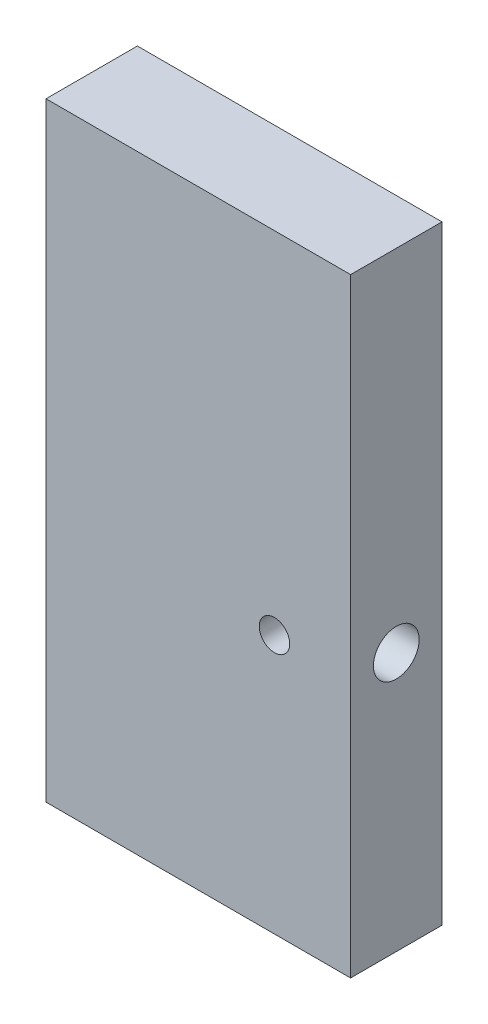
ISO-10303-21;
HEADER;
FILE_DESCRIPTION(('STEP AP214'),'2;1');
FILE_NAME('part.step','',(''),(''),'','','');
FILE_SCHEMA(('AUTOMOTIVE_DESIGN { 1 0 10303 214 1 1 1 1 }'));
ENDSEC;
DATA;
#1=APPLICATION_CONTEXT('core data for automotive mechanical design processes');
#2=APPLICATION_PROTOCOL_DEFINITION('international standard','automotive_design',2000,#1);
#3=PRODUCT_CONTEXT('',#1,'mechanical');
#4=PRODUCT('Part','Part','',(#3));
#5=PRODUCT_RELATED_PRODUCT_CATEGORY('part','',(#4));
#6=PRODUCT_DEFINITION_FORMATION('','',#4);
#7=PRODUCT_DEFINITION_CONTEXT('part definition',#1,'design');
#8=PRODUCT_DEFINITION('design','',#6,#7);
#9=PRODUCT_DEFINITION_SHAPE('','',#8);
#10=(LENGTH_UNIT() NAMED_UNIT(*) SI_UNIT(.MILLI.,.METRE.));
#11=(NAMED_UNIT(*) PLANE_ANGLE_UNIT() SI_UNIT($,.RADIAN.));
#12=(NAMED_UNIT(*) SI_UNIT($,.STERADIAN.) SOLID_ANGLE_UNIT());
#13=UNCERTAINTY_MEASURE_WITH_UNIT(LENGTH_MEASURE(1.E-05),#10,'distance_accuracy_value','');
#14=(GEOMETRIC_REPRESENTATION_CONTEXT(3) GLOBAL_UNCERTAINTY_ASSIGNED_CONTEXT((#13)) GLOBAL_UNIT_ASSIGNED_CONTEXT((#10,
#11,#12)) REPRESENTATION_CONTEXT('',''));
#15=CARTESIAN_POINT('',(0.,0.,0.));
#16=DIRECTION('',(0.,0.,1.));
#17=DIRECTION('',(1.,0.,0.));
#18=AXIS2_PLACEMENT_3D('',#15,#16,#17);
#19=CARTESIAN_POINT('',(-25.1688888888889,21.701746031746,6.));
#20=DIRECTION('',(1.,0.,0.));
#21=DIRECTION('',(0.,1.,0.));
#22=AXIS2_PLACEMENT_3D('',#19,#20,#21);
#23=PLANE('',#22);
#24=DIRECTION('',(0.,-1.,0.));
#25=VECTOR('',#24,1.);
#26=CARTESIAN_POINT('',(-25.1688888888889,21.701746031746,0.));
#27=LINE('',#26,#25);
#28=CARTESIAN_POINT('',(-25.1688888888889,21.701746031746,0.));
#29=VERTEX_POINT('',#28);
#30=CARTESIAN_POINT('',(-25.1688888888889,-18.298253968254,0.));
#31=VERTEX_POINT('',#30);
#32=EDGE_CURVE('E77',#29,#31,#27,.T.);
#33=ORIENTED_EDGE('',*,*,#32,.T.);
#34=DIRECTION('',(0.,0.,-1.));
#35=VECTOR('',#34,1.);
#36=CARTESIAN_POINT('',(-25.1688888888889,-18.298253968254,6.));
#37=LINE('',#36,#35);
#38=CARTESIAN_POINT('',(-25.1688888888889,-18.298253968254,6.));
#39=VERTEX_POINT('',#38);
#40=EDGE_CURVE('E11',#39,#31,#37,.T.);
#41=ORIENTED_EDGE('',*,*,#40,.F.);
#42=DIRECTION('',(0.,-1.,0.));
#43=VECTOR('',#42,1.);
#44=CARTESIAN_POINT('',(-25.1688888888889,21.701746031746,6.));
#45=LINE('',#44,#43);
#46=CARTESIAN_POINT('',(-25.1688888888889,21.701746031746,6.));
#47=VERTEX_POINT('',#46);
#48=EDGE_CURVE('E100',#47,#39,#45,.T.);
#49=ORIENTED_EDGE('',*,*,#48,.F.);
#50=DIRECTION('',(0.,0.,-1.));
#51=VECTOR('',#50,1.);
#52=CARTESIAN_POINT('',(-25.1688888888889,21.701746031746,6.));
#53=LINE('',#52,#51);
#54=EDGE_CURVE('E89',#47,#29,#53,.T.);
#55=ORIENTED_EDGE('',*,*,#54,.T.);
#56=EDGE_LOOP('',(#33,#41,#49,#55));
#57=FACE_BOUND('',#56,.T.);
#58=ADVANCED_FACE('F28',(#57),#23,.F.);
#59=CARTESIAN_POINT('',(-25.1688888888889,-18.298253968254,6.));
#60=DIRECTION('',(0.,1.,0.));
#61=DIRECTION('',(0.,0.,1.));
#62=AXIS2_PLACEMENT_3D('',#59,#60,#61);
#63=PLANE('',#62);
#64=DIRECTION('',(1.,0.,0.));
#65=VECTOR('',#64,1.);
#66=CARTESIAN_POINT('',(-25.1688888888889,-18.298253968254,0.));
#67=LINE('',#66,#65);
#68=CARTESIAN_POINT('',(-5.16888888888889,-18.298253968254,0.));
#69=VERTEX_POINT('',#68);
#70=EDGE_CURVE('E73',#31,#69,#67,.T.);
#71=ORIENTED_EDGE('',*,*,#70,.T.);
#72=DIRECTION('',(0.,0.,-1.));
#73=VECTOR('',#72,1.);
#74=CARTESIAN_POINT('',(-5.16888888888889,-18.298253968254,6.));
#75=LINE('',#74,#73);
#76=CARTESIAN_POINT('',(-5.16888888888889,-18.298253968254,6.));
#77=VERTEX_POINT('',#76);
#78=EDGE_CURVE('E40',#77,#69,#75,.T.);
#79=ORIENTED_EDGE('',*,*,#78,.F.);
#80=DIRECTION('',(1.,0.,0.));
#81=VECTOR('',#80,1.);
#82=CARTESIAN_POINT('',(-25.1688888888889,-18.298253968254,6.));
#83=LINE('',#82,#81);
#84=EDGE_CURVE('E85',#39,#77,#83,.T.);
#85=ORIENTED_EDGE('',*,*,#84,.F.);
#86=ORIENTED_EDGE('',*,*,#40,.T.);
#87=EDGE_LOOP('',(#71,#79,#85,#86));
#88=FACE_BOUND('',#87,.T.);
#89=ADVANCED_FACE('F84',(#88),#63,.F.);
#90=CARTESIAN_POINT('',(-5.16888888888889,21.701746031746,6.));
#91=DIRECTION('',(-1.,0.,0.));
#92=DIRECTION('',(0.,-1.,0.));
#93=AXIS2_PLACEMENT_3D('',#90,#91,#92);
#94=PLANE('',#93);
#95=CARTESIAN_POINT('',(-5.16888888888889,-1.29825396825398,3.));
#96=DIRECTION('',(1.,0.,0.));
#97=DIRECTION('',(0.,1.,0.));
#98=AXIS2_PLACEMENT_3D('',#95,#96,#97);
#99=CIRCLE('',#98,1.5);
#100=CARTESIAN_POINT('',(-5.16888888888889,0.201746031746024,3.));
#101=VERTEX_POINT('',#100);
#102=EDGE_CURVE('E93',#101,#101,#99,.T.);
#103=ORIENTED_EDGE('',*,*,#102,.F.);
#104=EDGE_LOOP('',(#103));
#105=FACE_BOUND('',#104,.T.);
#106=DIRECTION('',(0.,1.,0.));
#107=VECTOR('',#106,1.);
#108=CARTESIAN_POINT('',(-5.16888888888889,21.701746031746,0.));
#109=LINE('',#108,#107);
#110=CARTESIAN_POINT('',(-5.16888888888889,21.701746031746,0.));
#111=VERTEX_POINT('',#110);
#112=EDGE_CURVE('E78',#69,#111,#109,.T.);
#113=ORIENTED_EDGE('',*,*,#112,.T.);
#114=DIRECTION('',(0.,0.,-1.));
#115=VECTOR('',#114,1.);
#116=CARTESIAN_POINT('',(-5.16888888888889,21.701746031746,6.));
#117=LINE('',#116,#115);
#118=CARTESIAN_POINT('',(-5.16888888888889,21.701746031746,6.));
#119=VERTEX_POINT('',#118);
#120=EDGE_CURVE('E106',#119,#111,#117,.T.);
#121=ORIENTED_EDGE('',*,*,#120,.F.);
#122=DIRECTION('',(0.,1.,0.));
#123=VECTOR('',#122,1.);
#124=CARTESIAN_POINT('',(-5.16888888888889,21.701746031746,6.));
#125=LINE('',#124,#123);
#126=EDGE_CURVE('E52',#77,#119,#125,.T.);
#127=ORIENTED_EDGE('',*,*,#126,.F.);
#128=ORIENTED_EDGE('',*,*,#78,.T.);
#129=EDGE_LOOP('',(#113,#121,#127,#128));
#130=FACE_BOUND('',#129,.T.);
#131=ADVANCED_FACE('F110',(#105,#130),#94,.F.);
#132=CARTESIAN_POINT('',(-25.1688888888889,21.701746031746,6.));
#133=DIRECTION('',(0.,-1.,0.));
#134=DIRECTION('',(0.,0.,-1.));
#135=AXIS2_PLACEMENT_3D('',#132,#133,#134);
#136=PLANE('',#135);
#137=DIRECTION('',(-1.,0.,0.));
#138=VECTOR('',#137,1.);
#139=CARTESIAN_POINT('',(-25.1688888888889,21.701746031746,0.));
#140=LINE('',#139,#138);
#141=EDGE_CURVE('E98',#111,#29,#140,.T.);
#142=ORIENTED_EDGE('',*,*,#141,.T.);
#143=ORIENTED_EDGE('',*,*,#54,.F.);
#144=DIRECTION('',(-1.,0.,0.));
#145=VECTOR('',#144,1.);
#146=CARTESIAN_POINT('',(-25.1688888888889,21.701746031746,6.));
#147=LINE('',#146,#145);
#148=EDGE_CURVE('E47',#119,#47,#147,.T.);
#149=ORIENTED_EDGE('',*,*,#148,.F.);
#150=ORIENTED_EDGE('',*,*,#120,.T.);
#151=EDGE_LOOP('',(#142,#143,#149,#150));
#152=FACE_BOUND('',#151,.T.);
#153=ADVANCED_FACE('F112',(#152),#136,.F.);
#154=CARTESIAN_POINT('',(-25.1688888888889,-18.298253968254,6.));
#155=DIRECTION('',(0.,0.,1.));
#156=DIRECTION('',(1.,0.,0.));
#157=AXIS2_PLACEMENT_3D('',#154,#155,#156);
#158=PLANE('',#157);
#159=CARTESIAN_POINT('',(-10.1688888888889,-1.29825396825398,6.));
#160=DIRECTION('',(0.,0.,1.));
#161=DIRECTION('',(1.,0.,0.));
#162=AXIS2_PLACEMENT_3D('',#159,#160,#161);
#163=CIRCLE('',#162,1.);
#164=CARTESIAN_POINT('',(-9.16888888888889,-1.29825396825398,6.));
#165=VERTEX_POINT('',#164);
#166=EDGE_CURVE('E142',#165,#165,#163,.T.);
#167=ORIENTED_EDGE('',*,*,#166,.F.);
#168=EDGE_LOOP('',(#167));
#169=FACE_BOUND('',#168,.T.);
#170=ORIENTED_EDGE('',*,*,#48,.T.);
#171=ORIENTED_EDGE('',*,*,#84,.T.);
#172=ORIENTED_EDGE('',*,*,#126,.T.);
#173=ORIENTED_EDGE('',*,*,#148,.T.);
#174=EDGE_LOOP('',(#170,#171,#172,#173));
#175=FACE_BOUND('',#174,.T.);
#176=ADVANCED_FACE('F113',(#169,#175),#158,.T.);
#177=CARTESIAN_POINT('',(-25.1688888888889,-18.298253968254,0.));
#178=DIRECTION('',(0.,0.,1.));
#179=DIRECTION('',(1.,0.,0.));
#180=AXIS2_PLACEMENT_3D('',#177,#178,#179);
#181=PLANE('',#180);
#182=ORIENTED_EDGE('',*,*,#32,.F.);
#183=ORIENTED_EDGE('',*,*,#141,.F.);
#184=ORIENTED_EDGE('',*,*,#112,.F.);
#185=ORIENTED_EDGE('',*,*,#70,.F.);
#186=EDGE_LOOP('',(#182,#183,#184,#185));
#187=FACE_BOUND('',#186,.T.);
#188=ADVANCED_FACE('F74',(#187),#181,.F.);
#189=CARTESIAN_POINT('',(-15.1688888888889,-1.29825396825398,3.));
#190=DIRECTION('',(1.,0.,0.));
#191=DIRECTION('',(0.,1.,0.));
#192=AXIS2_PLACEMENT_3D('',#189,#190,#191);
#193=CYLINDRICAL_SURFACE('',#192,1.5);
#194=CARTESIAN_POINT('',(-9.16888888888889,-1.29825396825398,4.5));
#195=CARTESIAN_POINT('',(-9.16888861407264,-1.24801160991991,4.50000020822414));
#196=CARTESIAN_POINT('',(-9.17269587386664,-1.19776942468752,4.49745401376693));
#197=CARTESIAN_POINT('',(-9.18768732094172,-1.09888743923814,4.48752326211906));
#198=CARTESIAN_POINT('',(-9.19887501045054,-1.05024841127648,4.48013640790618));
#199=CARTESIAN_POINT('',(-9.22794274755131,-0.956147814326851,4.46125241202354));
#200=CARTESIAN_POINT('',(-9.24579145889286,-0.910672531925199,4.44977452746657));
#201=CARTESIAN_POINT('',(-9.28742057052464,-0.823546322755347,4.4236306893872));
#202=CARTESIAN_POINT('',(-9.31120183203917,-0.781895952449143,4.40896427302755));
#203=CARTESIAN_POINT('',(-9.36621735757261,-0.699611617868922,4.37613664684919));
#204=CARTESIAN_POINT('',(-9.39791281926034,-0.659363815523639,4.3577844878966));
#205=CARTESIAN_POINT('',(-9.46675391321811,-0.584389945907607,4.31991156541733));
#206=CARTESIAN_POINT('',(-9.50390735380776,-0.549671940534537,4.30038915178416));
#207=CARTESIAN_POINT('',(-9.58941507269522,-0.481142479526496,4.25864132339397));
#208=CARTESIAN_POINT('',(-9.63861171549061,-0.448338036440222,4.23647533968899));
#209=CARTESIAN_POINT('',(-9.74307057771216,-0.391502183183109,4.19542073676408));
#210=CARTESIAN_POINT('',(-9.79832208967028,-0.367455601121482,4.17652647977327));
#211=CARTESIAN_POINT('',(-9.89724453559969,-0.334883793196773,4.14988133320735));
#212=CARTESIAN_POINT('',(-9.9396531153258,-0.323881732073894,4.14048813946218));
#213=CARTESIAN_POINT('',(-10.0262611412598,-0.307500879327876,4.12628984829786));
#214=CARTESIAN_POINT('',(-10.0704573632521,-0.302112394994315,4.12147684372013));
#215=CARTESIAN_POINT('',(-10.159626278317,-0.297297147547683,4.11718302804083));
#216=CARTESIAN_POINT('',(-10.2046014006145,-0.297894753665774,4.11772401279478));
#217=CARTESIAN_POINT('',(-10.2937063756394,-0.305066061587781,4.12409887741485));
#218=CARTESIAN_POINT('',(-10.3378354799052,-0.311644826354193,4.12993724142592));
#219=CARTESIAN_POINT('',(-10.4221224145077,-0.329928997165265,4.14563592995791));
#220=CARTESIAN_POINT('',(-10.4623695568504,-0.341395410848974,4.15530744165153));
#221=CARTESIAN_POINT('',(-10.5404007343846,-0.368903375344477,4.17754811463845));
#222=CARTESIAN_POINT('',(-10.5781839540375,-0.384946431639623,4.19011822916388));
#223=CARTESIAN_POINT('',(-10.65840158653,-0.424884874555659,4.21982098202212));
#224=CARTESIAN_POINT('',(-10.700218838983,-0.449713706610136,4.23736158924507));
#225=CARTESIAN_POINT('',(-10.7795805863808,-0.504909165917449,4.27345768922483));
#226=CARTESIAN_POINT('',(-10.817119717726,-0.53528262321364,4.29201441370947));
#227=CARTESIAN_POINT('',(-10.8951601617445,-0.608348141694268,4.33271671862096));
#228=CARTESIAN_POINT('',(-10.9345559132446,-0.65228427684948,4.35477372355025));
#229=CARTESIAN_POINT('',(-11.0054871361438,-0.74724996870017,4.39609050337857));
#230=CARTESIAN_POINT('',(-11.0370299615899,-0.798272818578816,4.41535288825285));
#231=CARTESIAN_POINT('',(-11.0856277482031,-0.895825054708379,4.44572702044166));
#232=CARTESIAN_POINT('',(-11.1043105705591,-0.941275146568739,4.45769630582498));
#233=CARTESIAN_POINT('',(-11.1349413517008,-1.03523594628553,4.47753859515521));
#234=CARTESIAN_POINT('',(-11.1468950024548,-1.08374402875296,4.48541506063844));
#235=CARTESIAN_POINT('',(-11.1634694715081,-1.18276124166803,4.49637941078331));
#236=CARTESIAN_POINT('',(-11.1680586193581,-1.23327806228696,4.49944661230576));
#237=CARTESIAN_POINT('',(-11.1695124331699,-1.3344747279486,4.50041557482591));
#238=CARTESIAN_POINT('',(-11.1663776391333,-1.38515456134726,4.49831769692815));
#239=CARTESIAN_POINT('',(-11.1530768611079,-1.48148182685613,4.48949794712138));
#240=CARTESIAN_POINT('',(-11.1434202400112,-1.52723269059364,4.48311123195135));
#241=CARTESIAN_POINT('',(-11.1180910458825,-1.61631216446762,4.46659224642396));
#242=CARTESIAN_POINT('',(-11.102417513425,-1.65964038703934,4.45645937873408));
#243=CARTESIAN_POINT('',(-11.0645627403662,-1.7455863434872,4.4324817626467));
#244=CARTESIAN_POINT('',(-11.0420448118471,-1.78800206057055,4.41844935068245));
#245=CARTESIAN_POINT('',(-10.9916722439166,-1.86859548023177,4.38800927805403));
#246=CARTESIAN_POINT('',(-10.9638143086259,-1.90677054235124,4.37160015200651));
#247=CARTESIAN_POINT('',(-10.8985849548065,-1.9841811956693,4.33477273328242));
#248=CARTESIAN_POINT('',(-10.8604057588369,-2.02262990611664,4.31413078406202));
#249=CARTESIAN_POINT('',(-10.7783331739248,-2.09292380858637,4.27285586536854));
#250=CARTESIAN_POINT('',(-10.7344358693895,-2.12476443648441,4.25222291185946));
#251=CARTESIAN_POINT('',(-10.6453176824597,-2.17887785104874,4.21469839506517));
#252=CARTESIAN_POINT('',(-10.600522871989,-2.20173214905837,4.19763798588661));
#253=CARTESIAN_POINT('',(-10.5069525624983,-2.24073503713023,4.16719487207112));
#254=CARTESIAN_POINT('',(-10.4581844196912,-2.25689569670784,4.1538055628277));
#255=CARTESIAN_POINT('',(-10.3666066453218,-2.2794331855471,4.13466604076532));
#256=CARTESIAN_POINT('',(-10.3243029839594,-2.28704695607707,4.12797499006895));
#257=CARTESIAN_POINT('',(-10.2386022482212,-2.29674999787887,4.11939733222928));
#258=CARTESIAN_POINT('',(-10.1952064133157,-2.29884526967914,4.11750550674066));
#259=CARTESIAN_POINT('',(-10.1085673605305,-2.29737357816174,4.11882100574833));
#260=CARTESIAN_POINT('',(-10.0653242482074,-2.29380326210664,4.12203134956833));
#261=CARTESIAN_POINT('',(-9.9802171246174,-2.28123895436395,4.1330522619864));
#262=CARTESIAN_POINT('',(-9.9383550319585,-2.27223772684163,4.14086896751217));
#263=CARTESIAN_POINT('',(-9.84603329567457,-2.24621914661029,4.1626342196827));
#264=CARTESIAN_POINT('',(-9.79625503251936,-2.22770490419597,4.17766166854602));
#265=CARTESIAN_POINT('',(-9.70114547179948,-2.18367659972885,4.21111080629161));
#266=CARTESIAN_POINT('',(-9.65582053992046,-2.1581527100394,4.22953724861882));
#267=CARTESIAN_POINT('',(-9.56924794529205,-2.10024537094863,4.26808593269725));
#268=CARTESIAN_POINT('',(-9.52808951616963,-2.06774551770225,4.2882329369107));
#269=CARTESIAN_POINT('',(-9.45122764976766,-1.99661280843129,4.32814150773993));
#270=CARTESIAN_POINT('',(-9.41552589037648,-1.95797807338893,4.3479029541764));
#271=CARTESIAN_POINT('',(-9.34553283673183,-1.86898263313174,4.38815775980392));
#272=CARTESIAN_POINT('',(-9.31217956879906,-1.81773480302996,4.40834902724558));
#273=CARTESIAN_POINT('',(-9.2549322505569,-1.70868824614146,4.44388832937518));
#274=CARTESIAN_POINT('',(-9.23102333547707,-1.650899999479,4.45924396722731));
#275=CARTESIAN_POINT('',(-9.19831159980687,-1.5439715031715,4.48050822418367));
#276=CARTESIAN_POINT('',(-9.18733336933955,-1.49576013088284,4.48775740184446));
#277=CARTESIAN_POINT('',(-9.17262487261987,-1.39778297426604,4.49750140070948));
#278=CARTESIAN_POINT('',(-9.16888916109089,-1.34801838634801,4.49999979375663));
#279=CARTESIAN_POINT('',(-9.16888888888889,-1.29825396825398,4.5));
#280=B_SPLINE_CURVE_WITH_KNOTS('',3,(#194,#195,#196,#197,#198,#199,#200,#201,#202,#203,#204,
#205,#206,#207,#208,#209,#210,#211,#212,#213,#214,#215,#216,#217,#218,#219,#220,#221,#222,#223,
#224,#225,#226,#227,#228,#229,#230,#231,#232,#233,#234,#235,#236,#237,#238,#239,#240,#241,#242,
#243,#244,#245,#246,#247,#248,#249,#250,#251,#252,#253,#254,#255,#256,#257,#258,#259,#260,#261,
#262,#263,#264,#265,#266,#267,#268,#269,#270,#271,#272,#273,#274,#275,#276,#277,#278,#279),
.UNSPECIFIED.,.T.,.F.,(4,2,2,2,2,2,2,2,2,2,2,2,2,2,2,2,2,2,2,2,2,2,2,2,2,2,2,2,2,2,2,2,2,2,2,2,
2,2,2,2,2,2,4),(0.,0.1505266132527,0.301124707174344,0.451023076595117,0.600943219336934,
0.763585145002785,0.926462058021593,1.11503341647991,1.3032765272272,1.43716846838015,
1.57082883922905,1.70503355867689,1.83935198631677,1.96774431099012,2.0961789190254,
2.25073787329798,2.40548851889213,2.59359477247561,2.78152420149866,2.93262043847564,
3.08358867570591,3.2352044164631,3.38680955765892,3.52776542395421,3.6687437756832,
3.81826173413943,3.96787227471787,4.1411408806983,4.31452876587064,4.47324967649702,
4.63168313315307,4.76162024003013,4.89141600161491,5.02128860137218,5.15133461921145,
5.31603304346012,5.48096356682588,5.64889622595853,5.81688041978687,6.00897675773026,
6.20076953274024,6.34997645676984,6.49907115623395),.UNSPECIFIED.);
#281=CARTESIAN_POINT('',(-9.16888888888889,-1.29825396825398,4.5));
#282=VERTEX_POINT('',#281);
#283=EDGE_CURVE('E31',#282,#282,#280,.T.);
#284=ORIENTED_EDGE('',*,*,#283,.T.);
#285=EDGE_LOOP('',(#284));
#286=FACE_BOUND('',#285,.T.);
#287=CARTESIAN_POINT('',(-15.1688888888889,-1.29825396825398,3.));
#288=DIRECTION('',(1.,0.,0.));
#289=DIRECTION('',(0.,1.,0.));
#290=AXIS2_PLACEMENT_3D('',#287,#288,#289);
#291=CIRCLE('',#290,1.5);
#292=CARTESIAN_POINT('',(-15.1688888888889,0.201746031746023,3.));
#293=VERTEX_POINT('',#292);
#294=EDGE_CURVE('E90',#293,#293,#291,.T.);
#295=ORIENTED_EDGE('',*,*,#294,.F.);
#296=EDGE_LOOP('',(#295));
#297=FACE_BOUND('',#296,.T.);
#298=ORIENTED_EDGE('',*,*,#102,.T.);
#299=EDGE_LOOP('',(#298));
#300=FACE_BOUND('',#299,.T.);
#301=ADVANCED_FACE('F122',(#286,#297,#300),#193,.F.);
#302=CARTESIAN_POINT('',(-15.1688888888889,-1.29825396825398,3.));
#303=DIRECTION('',(1.,0.,0.));
#304=DIRECTION('',(0.,1.,0.));
#305=AXIS2_PLACEMENT_3D('',#302,#303,#304);
#306=PLANE('',#305);
#307=ORIENTED_EDGE('',*,*,#294,.T.);
#308=EDGE_LOOP('',(#307));
#309=FACE_BOUND('',#308,.T.);
#310=ADVANCED_FACE('F149',(#309),#306,.T.);
#311=CARTESIAN_POINT('',(-10.1688888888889,-1.29825396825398,4.));
#312=DIRECTION('',(0.,0.,1.));
#313=DIRECTION('',(1.,0.,0.));
#314=AXIS2_PLACEMENT_3D('',#311,#312,#313);
#315=CYLINDRICAL_SURFACE('',#314,1.);
#316=ORIENTED_EDGE('',*,*,#166,.T.);
#317=EDGE_LOOP('',(#316));
#318=FACE_BOUND('',#317,.T.);
#319=ORIENTED_EDGE('',*,*,#283,.F.);
#320=EDGE_LOOP('',(#319));
#321=FACE_BOUND('',#320,.T.);
#322=ADVANCED_FACE('F146',(#318,#321),#315,.F.);
#323=CLOSED_SHELL('',(#58,#89,#131,#153,#176,#188,#301,#310,#322));
#324=MANIFOLD_SOLID_BREP('B2',#323);
#325=ADVANCED_BREP_SHAPE_REPRESENTATION('',(#18,#324),#14);
#326=SHAPE_DEFINITION_REPRESENTATION(#9,#325);
ENDSEC;
END-ISO-10303-21;
